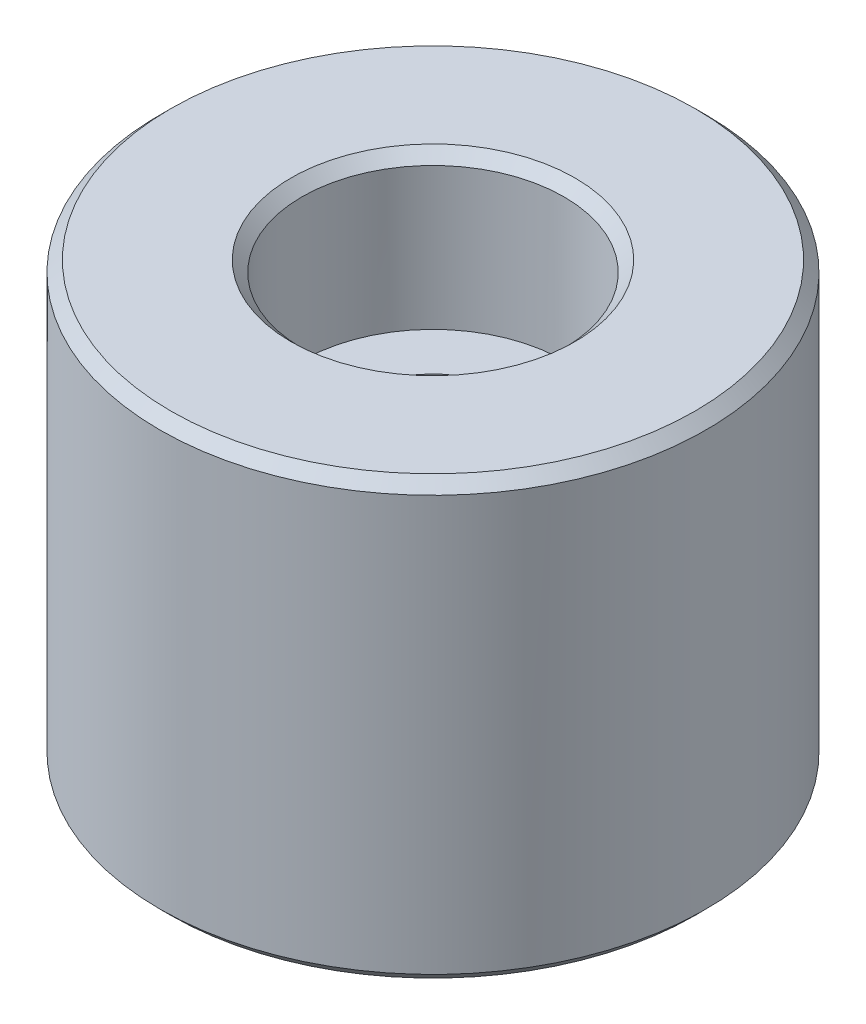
ISO-10303-21;
HEADER;
FILE_DESCRIPTION(('STEP AP214'),'2;1');
FILE_NAME('part.step','',(''),(''),'','','');
FILE_SCHEMA(('AUTOMOTIVE_DESIGN { 1 0 10303 214 1 1 1 1 }'));
ENDSEC;
DATA;
#1=APPLICATION_CONTEXT('core data for automotive mechanical design processes');
#2=APPLICATION_PROTOCOL_DEFINITION('international standard','automotive_design',2000,#1);
#3=PRODUCT_CONTEXT('',#1,'mechanical');
#4=PRODUCT('Part','Part','',(#3));
#5=PRODUCT_RELATED_PRODUCT_CATEGORY('part','',(#4));
#6=PRODUCT_DEFINITION_FORMATION('','',#4);
#7=PRODUCT_DEFINITION_CONTEXT('part definition',#1,'design');
#8=PRODUCT_DEFINITION('design','',#6,#7);
#9=PRODUCT_DEFINITION_SHAPE('','',#8);
#10=(LENGTH_UNIT() NAMED_UNIT(*) SI_UNIT(.MILLI.,.METRE.));
#11=(NAMED_UNIT(*) PLANE_ANGLE_UNIT() SI_UNIT($,.RADIAN.));
#12=(NAMED_UNIT(*) SI_UNIT($,.STERADIAN.) SOLID_ANGLE_UNIT());
#13=UNCERTAINTY_MEASURE_WITH_UNIT(LENGTH_MEASURE(1.E-05),#10,'distance_accuracy_value','');
#14=(GEOMETRIC_REPRESENTATION_CONTEXT(3) GLOBAL_UNCERTAINTY_ASSIGNED_CONTEXT((#13)) GLOBAL_UNIT_ASSIGNED_CONTEXT((#10,
#11,#12)) REPRESENTATION_CONTEXT('',''));
#15=CARTESIAN_POINT('',(0.,0.,0.));
#16=DIRECTION('',(0.,0.,1.));
#17=DIRECTION('',(1.,0.,0.));
#18=AXIS2_PLACEMENT_3D('',#15,#16,#17);
#19=CARTESIAN_POINT('',(3.50000000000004,-4.,0.));
#20=DIRECTION('',(0.,1.,0.));
#21=DIRECTION('',(0.,0.,1.));
#22=AXIS2_PLACEMENT_3D('',#19,#20,#21);
#23=PLANE('',#22);
#24=CARTESIAN_POINT('',(0.,-4.,0.));
#25=DIRECTION('',(0.,1.,0.));
#26=DIRECTION('',(0.,0.,1.));
#27=AXIS2_PLACEMENT_3D('',#24,#25,#26);
#28=CIRCLE('',#27,5.5);
#29=CARTESIAN_POINT('',(0.,-4.,5.5));
#30=VERTEX_POINT('',#29);
#31=EDGE_CURVE('E36',#30,#30,#28,.F.);
#32=ORIENTED_EDGE('',*,*,#31,.T.);
#33=EDGE_LOOP('',(#32));
#34=FACE_BOUND('',#33,.T.);
#35=CARTESIAN_POINT('',(0.,-4.,0.));
#36=DIRECTION('',(0.,1.,0.));
#37=DIRECTION('',(0.,0.,1.));
#38=AXIS2_PLACEMENT_3D('',#35,#36,#37);
#39=CIRCLE('',#38,4.00000000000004);
#40=CARTESIAN_POINT('',(0.,-4.,4.00000000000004));
#41=VERTEX_POINT('',#40);
#42=EDGE_CURVE('E40',#41,#41,#39,.T.);
#43=ORIENTED_EDGE('',*,*,#42,.T.);
#44=EDGE_LOOP('',(#43));
#45=FACE_BOUND('',#44,.T.);
#46=ADVANCED_FACE('F29',(#34,#45),#23,.F.);
#47=CARTESIAN_POINT('',(0.,50.,0.));
#48=DIRECTION('',(0.,1.,0.));
#49=DIRECTION('',(0.,0.,1.));
#50=AXIS2_PLACEMENT_3D('',#47,#48,#49);
#51=CYLINDRICAL_SURFACE('',#50,6.00000000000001);
#52=CARTESIAN_POINT('',(0.,-3.5,0.));
#53=DIRECTION('',(0.,1.,0.));
#54=DIRECTION('',(0.,0.,1.));
#55=AXIS2_PLACEMENT_3D('',#52,#53,#54);
#56=CIRCLE('',#55,6.00000000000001);
#57=CARTESIAN_POINT('',(0.,-3.5,6.00000000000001));
#58=VERTEX_POINT('',#57);
#59=EDGE_CURVE('E44',#58,#58,#56,.T.);
#60=ORIENTED_EDGE('',*,*,#59,.T.);
#61=EDGE_LOOP('',(#60));
#62=FACE_BOUND('',#61,.T.);
#63=CARTESIAN_POINT('',(0.,0.,0.));
#64=DIRECTION('',(0.,1.,0.));
#65=DIRECTION('',(0.,0.,1.));
#66=AXIS2_PLACEMENT_3D('',#63,#64,#65);
#67=CIRCLE('',#66,6.00000000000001);
#68=CARTESIAN_POINT('',(0.,0.,6.00000000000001));
#69=VERTEX_POINT('',#68);
#70=EDGE_CURVE('E67',#69,#69,#67,.T.);
#71=ORIENTED_EDGE('',*,*,#70,.F.);
#72=EDGE_LOOP('',(#71));
#73=FACE_BOUND('',#72,.T.);
#74=ADVANCED_FACE('F97',(#62,#73),#51,.T.);
#75=CARTESIAN_POINT('',(6.00000000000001,0.,0.));
#76=DIRECTION('',(0.,1.,0.));
#77=DIRECTION('',(0.,0.,1.));
#78=AXIS2_PLACEMENT_3D('',#75,#76,#77);
#79=PLANE('',#78);
#80=CARTESIAN_POINT('',(0.,0.,0.));
#81=DIRECTION('',(0.,1.,0.));
#82=DIRECTION('',(0.,0.,1.));
#83=AXIS2_PLACEMENT_3D('',#80,#81,#82);
#84=CIRCLE('',#83,12.);
#85=CARTESIAN_POINT('',(0.,0.,12.));
#86=VERTEX_POINT('',#85);
#87=EDGE_CURVE('E49',#86,#86,#84,.F.);
#88=ORIENTED_EDGE('',*,*,#87,.T.);
#89=EDGE_LOOP('',(#88));
#90=FACE_BOUND('',#89,.T.);
#91=ORIENTED_EDGE('',*,*,#70,.T.);
#92=EDGE_LOOP('',(#91));
#93=FACE_BOUND('',#92,.T.);
#94=ADVANCED_FACE('F102',(#90,#93),#79,.F.);
#95=CARTESIAN_POINT('',(0.,50.,0.));
#96=DIRECTION('',(0.,1.,0.));
#97=DIRECTION('',(0.,0.,1.));
#98=AXIS2_PLACEMENT_3D('',#95,#96,#97);
#99=CYLINDRICAL_SURFACE('',#98,12.5);
#100=CARTESIAN_POINT('',(0.,19.5,0.));
#101=DIRECTION('',(0.,-1.,0.));
#102=DIRECTION('',(0.,0.,-1.));
#103=AXIS2_PLACEMENT_3D('',#100,#101,#102);
#104=CIRCLE('',#103,12.5);
#105=CARTESIAN_POINT('',(0.,19.5,-12.5));
#106=VERTEX_POINT('',#105);
#107=EDGE_CURVE('E55',#106,#106,#104,.T.);
#108=ORIENTED_EDGE('',*,*,#107,.T.);
#109=EDGE_LOOP('',(#108));
#110=FACE_BOUND('',#109,.T.);
#111=CARTESIAN_POINT('',(0.,0.5,0.));
#112=DIRECTION('',(0.,1.,0.));
#113=DIRECTION('',(0.,0.,1.));
#114=AXIS2_PLACEMENT_3D('',#111,#112,#113);
#115=CIRCLE('',#114,12.5);
#116=CARTESIAN_POINT('',(0.,0.5,12.5));
#117=VERTEX_POINT('',#116);
#118=EDGE_CURVE('E58',#117,#117,#115,.T.);
#119=ORIENTED_EDGE('',*,*,#118,.T.);
#120=EDGE_LOOP('',(#119));
#121=FACE_BOUND('',#120,.T.);
#122=ADVANCED_FACE('F93',(#110,#121),#99,.T.);
#123=CARTESIAN_POINT('',(12.5,20.,0.));
#124=DIRECTION('',(0.,-1.,0.));
#125=DIRECTION('',(0.,0.,-1.));
#126=AXIS2_PLACEMENT_3D('',#123,#124,#125);
#127=PLANE('',#126);
#128=CARTESIAN_POINT('',(0.,20.,0.));
#129=DIRECTION('',(0.,-1.,0.));
#130=DIRECTION('',(0.,0.,-1.));
#131=AXIS2_PLACEMENT_3D('',#128,#129,#130);
#132=CIRCLE('',#131,12.);
#133=CARTESIAN_POINT('',(0.,20.,-12.));
#134=VERTEX_POINT('',#133);
#135=EDGE_CURVE('E61',#134,#134,#132,.F.);
#136=ORIENTED_EDGE('',*,*,#135,.T.);
#137=EDGE_LOOP('',(#136));
#138=FACE_BOUND('',#137,.T.);
#139=CARTESIAN_POINT('',(0.,20.,0.));
#140=DIRECTION('',(0.,-1.,0.));
#141=DIRECTION('',(0.,0.,-1.));
#142=AXIS2_PLACEMENT_3D('',#139,#140,#141);
#143=CIRCLE('',#142,6.50000000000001);
#144=CARTESIAN_POINT('',(0.,20.,-6.50000000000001));
#145=VERTEX_POINT('',#144);
#146=EDGE_CURVE('E64',#145,#145,#143,.T.);
#147=ORIENTED_EDGE('',*,*,#146,.T.);
#148=EDGE_LOOP('',(#147));
#149=FACE_BOUND('',#148,.T.);
#150=ADVANCED_FACE('F87',(#138,#149),#127,.F.);
#151=CARTESIAN_POINT('',(0.,50.,0.));
#152=DIRECTION('',(0.,1.,0.));
#153=DIRECTION('',(0.,0.,1.));
#154=AXIS2_PLACEMENT_3D('',#151,#152,#153);
#155=CYLINDRICAL_SURFACE('',#154,6.00000000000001);
#156=CARTESIAN_POINT('',(0.,19.5,0.));
#157=DIRECTION('',(0.,-1.,0.));
#158=DIRECTION('',(0.,0.,-1.));
#159=AXIS2_PLACEMENT_3D('',#156,#157,#158);
#160=CIRCLE('',#159,6.00000000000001);
#161=CARTESIAN_POINT('',(0.,19.5,-6.00000000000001));
#162=VERTEX_POINT('',#161);
#163=EDGE_CURVE('E52',#162,#162,#160,.F.);
#164=ORIENTED_EDGE('',*,*,#163,.T.);
#165=EDGE_LOOP('',(#164));
#166=FACE_BOUND('',#165,.T.);
#167=CARTESIAN_POINT('',(0.,13.,0.));
#168=DIRECTION('',(0.,1.,0.));
#169=DIRECTION('',(0.,0.,1.));
#170=AXIS2_PLACEMENT_3D('',#167,#168,#169);
#171=CIRCLE('',#170,6.00000000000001);
#172=CARTESIAN_POINT('',(0.,13.,6.00000000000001));
#173=VERTEX_POINT('',#172);
#174=EDGE_CURVE('E70',#173,#173,#171,.T.);
#175=ORIENTED_EDGE('',*,*,#174,.F.);
#176=EDGE_LOOP('',(#175));
#177=FACE_BOUND('',#176,.T.);
#178=ADVANCED_FACE('F82',(#166,#177),#155,.F.);
#179=CARTESIAN_POINT('',(3.50000000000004,13.,0.));
#180=DIRECTION('',(0.,-1.,0.));
#181=DIRECTION('',(0.,0.,-1.));
#182=AXIS2_PLACEMENT_3D('',#179,#180,#181);
#183=PLANE('',#182);
#184=CARTESIAN_POINT('',(0.,13.,0.));
#185=DIRECTION('',(0.,1.,0.));
#186=DIRECTION('',(0.,0.,1.));
#187=AXIS2_PLACEMENT_3D('',#184,#185,#186);
#188=CIRCLE('',#187,3.50000000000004);
#189=CARTESIAN_POINT('',(0.,13.,3.50000000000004));
#190=VERTEX_POINT('',#189);
#191=EDGE_CURVE('E73',#190,#190,#188,.T.);
#192=ORIENTED_EDGE('',*,*,#191,.F.);
#193=EDGE_LOOP('',(#192));
#194=FACE_BOUND('',#193,.T.);
#195=ORIENTED_EDGE('',*,*,#174,.T.);
#196=EDGE_LOOP('',(#195));
#197=FACE_BOUND('',#196,.T.);
#198=ADVANCED_FACE('F79',(#194,#197),#183,.F.);
#199=CARTESIAN_POINT('',(0.,50.,0.));
#200=DIRECTION('',(0.,1.,0.));
#201=DIRECTION('',(0.,0.,1.));
#202=AXIS2_PLACEMENT_3D('',#199,#200,#201);
#203=CYLINDRICAL_SURFACE('',#202,3.50000000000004);
#204=CARTESIAN_POINT('',(0.,-3.5,0.));
#205=DIRECTION('',(0.,1.,0.));
#206=DIRECTION('',(0.,0.,1.));
#207=AXIS2_PLACEMENT_3D('',#204,#205,#206);
#208=CIRCLE('',#207,3.50000000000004);
#209=CARTESIAN_POINT('',(0.,-3.5,3.50000000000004));
#210=VERTEX_POINT('',#209);
#211=EDGE_CURVE('E10',#210,#210,#208,.F.);
#212=ORIENTED_EDGE('',*,*,#211,.T.);
#213=EDGE_LOOP('',(#212));
#214=FACE_BOUND('',#213,.T.);
#215=ORIENTED_EDGE('',*,*,#191,.T.);
#216=EDGE_LOOP('',(#215));
#217=FACE_BOUND('',#216,.T.);
#218=ADVANCED_FACE('F77',(#214,#217),#203,.F.);
#219=CARTESIAN_POINT('',(0.,20.,0.));
#220=DIRECTION('',(0.,-1.,0.));
#221=DIRECTION('',(0.,0.,-1.));
#222=AXIS2_PLACEMENT_3D('',#219,#220,#221);
#223=CONICAL_SURFACE('',#222,12.,0.785398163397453);
#224=ORIENTED_EDGE('',*,*,#107,.F.);
#225=EDGE_LOOP('',(#224));
#226=FACE_BOUND('',#225,.T.);
#227=ORIENTED_EDGE('',*,*,#135,.F.);
#228=EDGE_LOOP('',(#227));
#229=FACE_BOUND('',#228,.T.);
#230=ADVANCED_FACE('F108',(#226,#229),#223,.T.);
#231=CARTESIAN_POINT('',(0.,19.5,0.));
#232=DIRECTION('',(0.,1.,0.));
#233=DIRECTION('',(0.,0.,1.));
#234=AXIS2_PLACEMENT_3D('',#231,#232,#233);
#235=CONICAL_SURFACE('',#234,6.00000000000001,0.785398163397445);
#236=ORIENTED_EDGE('',*,*,#146,.F.);
#237=EDGE_LOOP('',(#236));
#238=FACE_BOUND('',#237,.T.);
#239=ORIENTED_EDGE('',*,*,#163,.F.);
#240=EDGE_LOOP('',(#239));
#241=FACE_BOUND('',#240,.T.);
#242=ADVANCED_FACE('F111',(#238,#241),#235,.F.);
#243=CARTESIAN_POINT('',(0.,0.5,0.));
#244=DIRECTION('',(0.,1.,0.));
#245=DIRECTION('',(0.,0.,1.));
#246=AXIS2_PLACEMENT_3D('',#243,#244,#245);
#247=CONICAL_SURFACE('',#246,12.5,0.785398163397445);
#248=ORIENTED_EDGE('',*,*,#87,.F.);
#249=EDGE_LOOP('',(#248));
#250=FACE_BOUND('',#249,.T.);
#251=ORIENTED_EDGE('',*,*,#118,.F.);
#252=EDGE_LOOP('',(#251));
#253=FACE_BOUND('',#252,.T.);
#254=ADVANCED_FACE('F115',(#250,#253),#247,.T.);
#255=CARTESIAN_POINT('',(0.,-3.5,0.));
#256=DIRECTION('',(0.,1.,0.));
#257=DIRECTION('',(0.,0.,1.));
#258=AXIS2_PLACEMENT_3D('',#255,#256,#257);
#259=CONICAL_SURFACE('',#258,6.00000000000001,0.78539816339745);
#260=ORIENTED_EDGE('',*,*,#31,.F.);
#261=EDGE_LOOP('',(#260));
#262=FACE_BOUND('',#261,.T.);
#263=ORIENTED_EDGE('',*,*,#59,.F.);
#264=EDGE_LOOP('',(#263));
#265=FACE_BOUND('',#264,.T.);
#266=ADVANCED_FACE('F118',(#262,#265),#259,.T.);
#267=CARTESIAN_POINT('',(0.,-4.,0.));
#268=DIRECTION('',(0.,-1.,0.));
#269=DIRECTION('',(0.,0.,-1.));
#270=AXIS2_PLACEMENT_3D('',#267,#268,#269);
#271=CONICAL_SURFACE('',#270,4.00000000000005,0.78539816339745);
#272=ORIENTED_EDGE('',*,*,#211,.F.);
#273=EDGE_LOOP('',(#272));
#274=FACE_BOUND('',#273,.T.);
#275=ORIENTED_EDGE('',*,*,#42,.F.);
#276=EDGE_LOOP('',(#275));
#277=FACE_BOUND('',#276,.T.);
#278=ADVANCED_FACE('F31',(#274,#277),#271,.F.);
#279=CLOSED_SHELL('',(#46,#74,#94,#122,#150,#178,#198,#218,#230,#242,#254,#266,#278));
#280=MANIFOLD_SOLID_BREP('B2',#279);
#281=ADVANCED_BREP_SHAPE_REPRESENTATION('',(#18,#280),#14);
#282=SHAPE_DEFINITION_REPRESENTATION(#9,#281);
ENDSEC;
END-ISO-10303-21;
